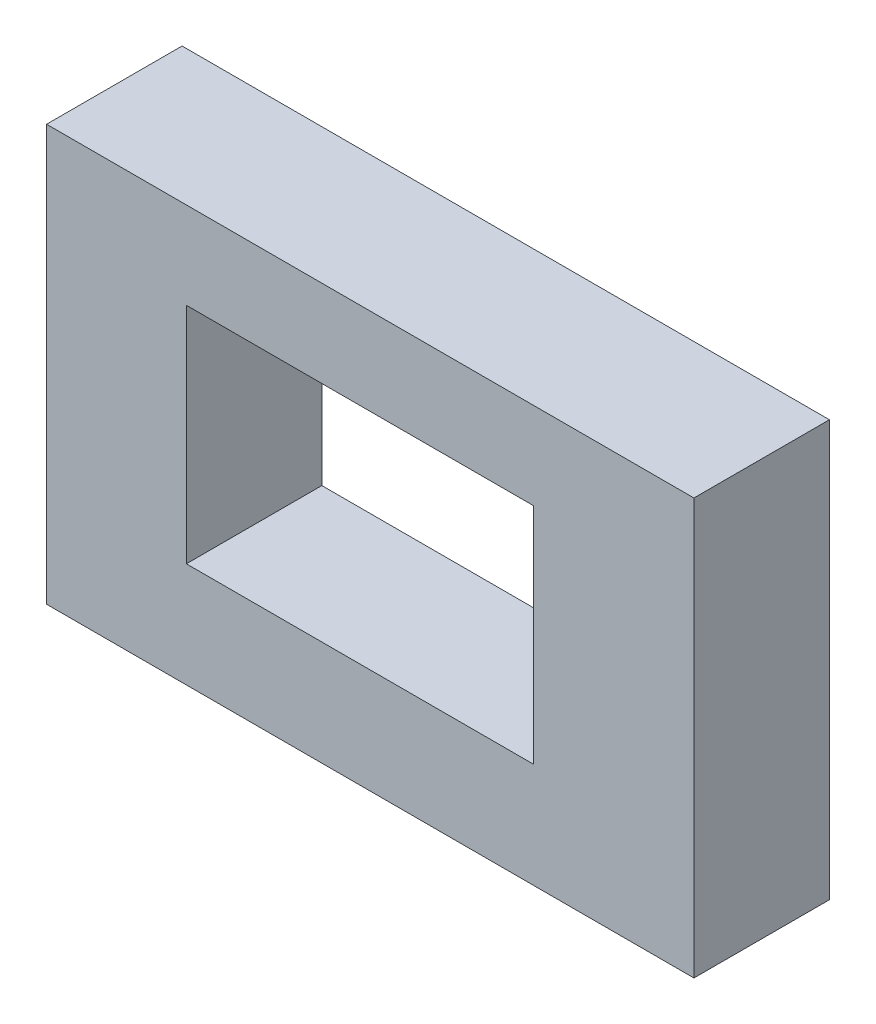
from build123d import *

# Parameters (mm, degrees)
SKETCH1_W           = 47.778292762
SKETCH1_H           = 30.683307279
SKETCH1_W_2         = 25.636006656
SKETCH1_H_2         = 16.524474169
BOSS_EXTRUDE1_DEPTH = 10


with BuildPart() as part:
    # Sketch1 → Boss-Extrude1 (new body)
    with BuildSketch(Plane.XY):
        with Locations((0, -0.876665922)):
            Rectangle(SKETCH1_W, SKETCH1_H)
        with Locations((-0.754000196, -0.211435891)):
            Rectangle(SKETCH1_W_2, SKETCH1_H_2, mode=Mode.SUBTRACT)
    extrude(amount=BOSS_EXTRUDE1_DEPTH)


solid = part.part
